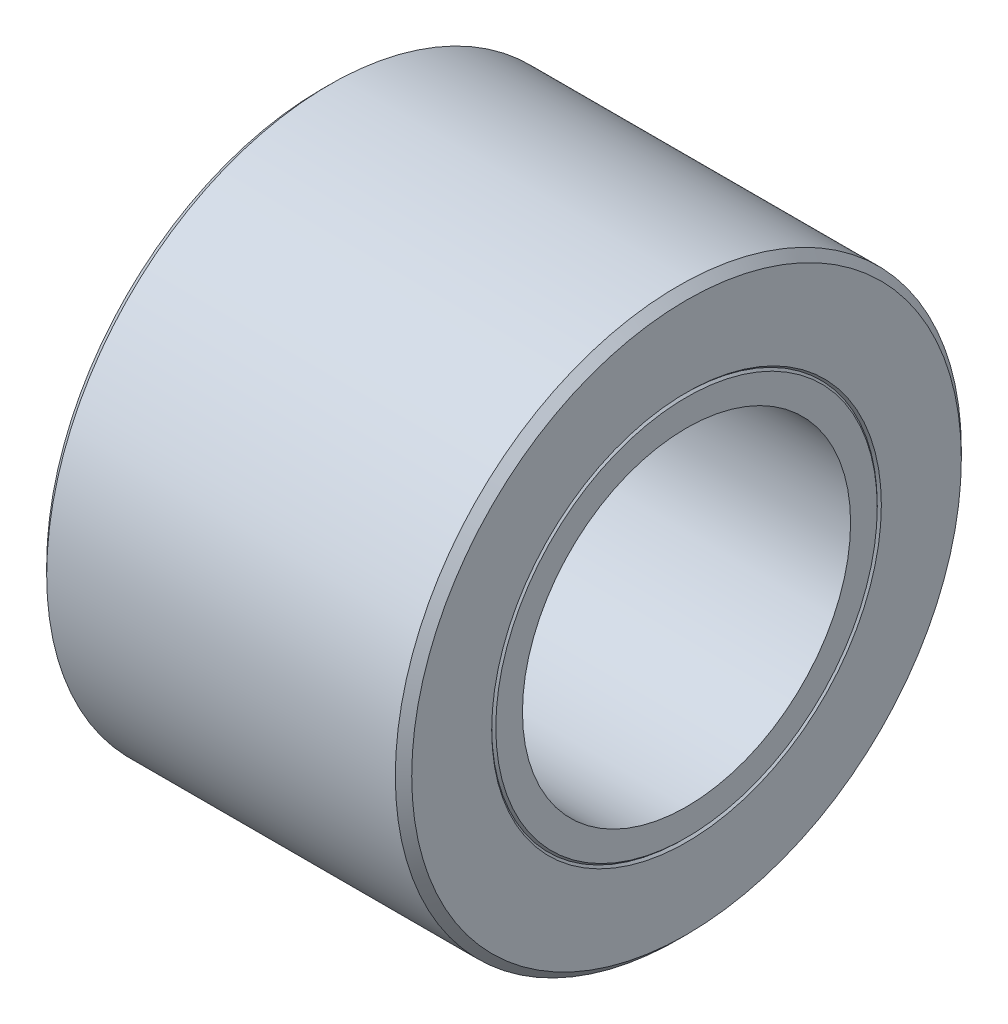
ISO-10303-21;
HEADER;
FILE_DESCRIPTION(('STEP AP214'),'2;1');
FILE_NAME('part.step','',(''),(''),'','','');
FILE_SCHEMA(('AUTOMOTIVE_DESIGN { 1 0 10303 214 1 1 1 1 }'));
ENDSEC;
DATA;
#1=APPLICATION_CONTEXT('core data for automotive mechanical design processes');
#2=APPLICATION_PROTOCOL_DEFINITION('international standard','automotive_design',2000,#1);
#3=PRODUCT_CONTEXT('',#1,'mechanical');
#4=PRODUCT('Part','Part','',(#3));
#5=PRODUCT_RELATED_PRODUCT_CATEGORY('part','',(#4));
#6=PRODUCT_DEFINITION_FORMATION('','',#4);
#7=PRODUCT_DEFINITION_CONTEXT('part definition',#1,'design');
#8=PRODUCT_DEFINITION('design','',#6,#7);
#9=PRODUCT_DEFINITION_SHAPE('','',#8);
#10=(LENGTH_UNIT() NAMED_UNIT(*) SI_UNIT(.MILLI.,.METRE.));
#11=(NAMED_UNIT(*) PLANE_ANGLE_UNIT() SI_UNIT($,.RADIAN.));
#12=(NAMED_UNIT(*) SI_UNIT($,.STERADIAN.) SOLID_ANGLE_UNIT());
#13=UNCERTAINTY_MEASURE_WITH_UNIT(LENGTH_MEASURE(1.E-05),#10,'distance_accuracy_value','');
#14=(GEOMETRIC_REPRESENTATION_CONTEXT(3) GLOBAL_UNCERTAINTY_ASSIGNED_CONTEXT((#13)) GLOBAL_UNIT_ASSIGNED_CONTEXT((#10,
#11,#12)) REPRESENTATION_CONTEXT('',''));
#15=CARTESIAN_POINT('',(0.,0.,0.));
#16=DIRECTION('',(0.,0.,1.));
#17=DIRECTION('',(1.,0.,0.));
#18=AXIS2_PLACEMENT_3D('',#15,#16,#17);
#19=CARTESIAN_POINT('',(4.45,2.,0.));
#20=DIRECTION('',(-1.,0.,0.));
#21=DIRECTION('',(0.,0.,1.));
#22=AXIS2_PLACEMENT_3D('',#19,#20,#21);
#23=PLANE('',#22);
#24=CARTESIAN_POINT('',(4.45,0.,0.));
#25=DIRECTION('',(-1.,0.,0.));
#26=DIRECTION('',(0.,0.,1.));
#27=AXIS2_PLACEMENT_3D('',#24,#25,#26);
#28=CIRCLE('',#27,2.);
#29=CARTESIAN_POINT('',(4.45,0.,2.));
#30=VERTEX_POINT('',#29);
#31=EDGE_CURVE('E51',#30,#30,#28,.T.);
#32=ORIENTED_EDGE('',*,*,#31,.T.);
#33=EDGE_LOOP('',(#32));
#34=FACE_BOUND('',#33,.T.);
#35=CARTESIAN_POINT('',(4.45,0.,0.));
#36=DIRECTION('',(1.,0.,0.));
#37=DIRECTION('',(0.,0.,-1.));
#38=AXIS2_PLACEMENT_3D('',#35,#36,#37);
#39=CIRCLE('',#38,2.325);
#40=CARTESIAN_POINT('',(4.45,0.,-2.325));
#41=VERTEX_POINT('',#40);
#42=EDGE_CURVE('E63',#41,#41,#39,.T.);
#43=ORIENTED_EDGE('',*,*,#42,.T.);
#44=EDGE_LOOP('',(#43));
#45=FACE_BOUND('',#44,.T.);
#46=ADVANCED_FACE('F31',(#34,#45),#23,.F.);
#47=CARTESIAN_POINT('',(0.,2.,0.));
#48=DIRECTION('',(1.,0.,0.));
#49=DIRECTION('',(0.,0.,-1.));
#50=AXIS2_PLACEMENT_3D('',#47,#48,#49);
#51=PLANE('',#50);
#52=CARTESIAN_POINT('',(0.,0.,0.));
#53=DIRECTION('',(-1.,0.,0.));
#54=DIRECTION('',(0.,0.,1.));
#55=AXIS2_PLACEMENT_3D('',#52,#53,#54);
#56=CIRCLE('',#55,2.);
#57=CARTESIAN_POINT('',(0.,0.,2.));
#58=VERTEX_POINT('',#57);
#59=EDGE_CURVE('E54',#58,#58,#56,.T.);
#60=ORIENTED_EDGE('',*,*,#59,.F.);
#61=EDGE_LOOP('',(#60));
#62=FACE_BOUND('',#61,.T.);
#63=CARTESIAN_POINT('',(0.,0.,0.));
#64=DIRECTION('',(-1.,0.,0.));
#65=DIRECTION('',(0.,0.,1.));
#66=AXIS2_PLACEMENT_3D('',#63,#64,#65);
#67=CIRCLE('',#66,3.35);
#68=CARTESIAN_POINT('',(0.,0.,3.35));
#69=VERTEX_POINT('',#68);
#70=EDGE_CURVE('E10',#69,#69,#67,.T.);
#71=ORIENTED_EDGE('',*,*,#70,.T.);
#72=EDGE_LOOP('',(#71));
#73=FACE_BOUND('',#72,.T.);
#74=ADVANCED_FACE('F33',(#62,#73),#51,.F.);
#75=CARTESIAN_POINT('',(0.1,0.,0.));
#76=DIRECTION('',(1.,0.,0.));
#77=DIRECTION('',(0.,0.,-1.));
#78=AXIS2_PLACEMENT_3D('',#75,#76,#77);
#79=CONICAL_SURFACE('',#78,3.45,0.785398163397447);
#80=ORIENTED_EDGE('',*,*,#70,.F.);
#81=EDGE_LOOP('',(#80));
#82=FACE_BOUND('',#81,.T.);
#83=CARTESIAN_POINT('',(0.1,0.,0.));
#84=DIRECTION('',(-1.,0.,0.));
#85=DIRECTION('',(0.,0.,1.));
#86=AXIS2_PLACEMENT_3D('',#83,#84,#85);
#87=CIRCLE('',#86,3.45);
#88=CARTESIAN_POINT('',(0.1,0.,3.45));
#89=VERTEX_POINT('',#88);
#90=EDGE_CURVE('E38',#89,#89,#87,.T.);
#91=ORIENTED_EDGE('',*,*,#90,.T.);
#92=EDGE_LOOP('',(#91));
#93=FACE_BOUND('',#92,.T.);
#94=ADVANCED_FACE('F86',(#82,#93),#79,.T.);
#95=CARTESIAN_POINT('',(0.,0.,0.));
#96=DIRECTION('',(-1.,0.,0.));
#97=DIRECTION('',(0.,0.,1.));
#98=AXIS2_PLACEMENT_3D('',#95,#96,#97);
#99=CYLINDRICAL_SURFACE('',#98,3.45);
#100=ORIENTED_EDGE('',*,*,#90,.F.);
#101=EDGE_LOOP('',(#100));
#102=FACE_BOUND('',#101,.T.);
#103=CARTESIAN_POINT('',(4.35,0.,0.));
#104=DIRECTION('',(-1.,0.,0.));
#105=DIRECTION('',(0.,0.,1.));
#106=AXIS2_PLACEMENT_3D('',#103,#104,#105);
#107=CIRCLE('',#106,3.45);
#108=CARTESIAN_POINT('',(4.35,0.,3.45));
#109=VERTEX_POINT('',#108);
#110=EDGE_CURVE('E42',#109,#109,#107,.T.);
#111=ORIENTED_EDGE('',*,*,#110,.T.);
#112=EDGE_LOOP('',(#111));
#113=FACE_BOUND('',#112,.T.);
#114=ADVANCED_FACE('F98',(#102,#113),#99,.T.);
#115=CARTESIAN_POINT('',(4.45,0.,0.));
#116=DIRECTION('',(-1.,0.,0.));
#117=DIRECTION('',(0.,0.,1.));
#118=AXIS2_PLACEMENT_3D('',#115,#116,#117);
#119=CONICAL_SURFACE('',#118,3.35,0.785398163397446);
#120=ORIENTED_EDGE('',*,*,#110,.F.);
#121=EDGE_LOOP('',(#120));
#122=FACE_BOUND('',#121,.T.);
#123=CARTESIAN_POINT('',(4.45,0.,0.));
#124=DIRECTION('',(-1.,0.,0.));
#125=DIRECTION('',(0.,0.,1.));
#126=AXIS2_PLACEMENT_3D('',#123,#124,#125);
#127=CIRCLE('',#126,3.35);
#128=CARTESIAN_POINT('',(4.45,0.,3.35));
#129=VERTEX_POINT('',#128);
#130=EDGE_CURVE('E46',#129,#129,#127,.T.);
#131=ORIENTED_EDGE('',*,*,#130,.T.);
#132=EDGE_LOOP('',(#131));
#133=FACE_BOUND('',#132,.T.);
#134=ADVANCED_FACE('F91',(#122,#133),#119,.T.);
#135=CARTESIAN_POINT('',(4.45,0.,0.));
#136=DIRECTION('',(1.,0.,0.));
#137=DIRECTION('',(0.,0.,-1.));
#138=AXIS2_PLACEMENT_3D('',#135,#136,#137);
#139=CIRCLE('',#138,2.375);
#140=CARTESIAN_POINT('',(4.45,0.,-2.375));
#141=VERTEX_POINT('',#140);
#142=EDGE_CURVE('E60',#141,#141,#139,.T.);
#143=ORIENTED_EDGE('',*,*,#142,.F.);
#144=EDGE_LOOP('',(#143));
#145=FACE_BOUND('',#144,.T.);
#146=ORIENTED_EDGE('',*,*,#130,.F.);
#147=EDGE_LOOP('',(#146));
#148=FACE_BOUND('',#147,.T.);
#149=ADVANCED_FACE('F82',(#145,#148),#23,.F.);
#150=CARTESIAN_POINT('',(0.,0.,0.));
#151=DIRECTION('',(-1.,0.,0.));
#152=DIRECTION('',(0.,0.,1.));
#153=AXIS2_PLACEMENT_3D('',#150,#151,#152);
#154=CYLINDRICAL_SURFACE('',#153,2.);
#155=ORIENTED_EDGE('',*,*,#31,.F.);
#156=EDGE_LOOP('',(#155));
#157=FACE_BOUND('',#156,.T.);
#158=ORIENTED_EDGE('',*,*,#59,.T.);
#159=EDGE_LOOP('',(#158));
#160=FACE_BOUND('',#159,.T.);
#161=ADVANCED_FACE('F76',(#157,#160),#154,.F.);
#162=CARTESIAN_POINT('',(4.45,0.,0.));
#163=DIRECTION('',(1.,0.,0.));
#164=DIRECTION('',(0.,0.,-1.));
#165=AXIS2_PLACEMENT_3D('',#162,#163,#164);
#166=CONICAL_SURFACE('',#165,2.375,0.78539816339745);
#167=ORIENTED_EDGE('',*,*,#142,.T.);
#168=EDGE_LOOP('',(#167));
#169=FACE_BOUND('',#168,.T.);
#170=CARTESIAN_POINT('',(4.425,0.,0.));
#171=DIRECTION('',(1.,0.,0.));
#172=DIRECTION('',(0.,0.,-1.));
#173=AXIS2_PLACEMENT_3D('',#170,#171,#172);
#174=CIRCLE('',#173,2.35);
#175=CARTESIAN_POINT('',(4.425,0.,-2.35));
#176=VERTEX_POINT('',#175);
#177=EDGE_CURVE('E57',#176,#176,#174,.T.);
#178=ORIENTED_EDGE('',*,*,#177,.F.);
#179=EDGE_LOOP('',(#178));
#180=FACE_BOUND('',#179,.T.);
#181=ADVANCED_FACE('F70',(#169,#180),#166,.F.);
#182=CARTESIAN_POINT('',(4.45,0.,0.));
#183=DIRECTION('',(-1.,0.,0.));
#184=DIRECTION('',(0.,0.,-1.));
#185=AXIS2_PLACEMENT_3D('',#182,#183,#184);
#186=CONICAL_SURFACE('',#185,2.325,0.78539816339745);
#187=ORIENTED_EDGE('',*,*,#177,.T.);
#188=EDGE_LOOP('',(#187));
#189=FACE_BOUND('',#188,.T.);
#190=ORIENTED_EDGE('',*,*,#42,.F.);
#191=EDGE_LOOP('',(#190));
#192=FACE_BOUND('',#191,.T.);
#193=ADVANCED_FACE('F68',(#189,#192),#186,.T.);
#194=CLOSED_SHELL('',(#46,#74,#94,#114,#134,#149,#161,#181,#193));
#195=MANIFOLD_SOLID_BREP('B2',#194);
#196=ADVANCED_BREP_SHAPE_REPRESENTATION('',(#18,#195),#14);
#197=SHAPE_DEFINITION_REPRESENTATION(#9,#196);
ENDSEC;
END-ISO-10303-21;
